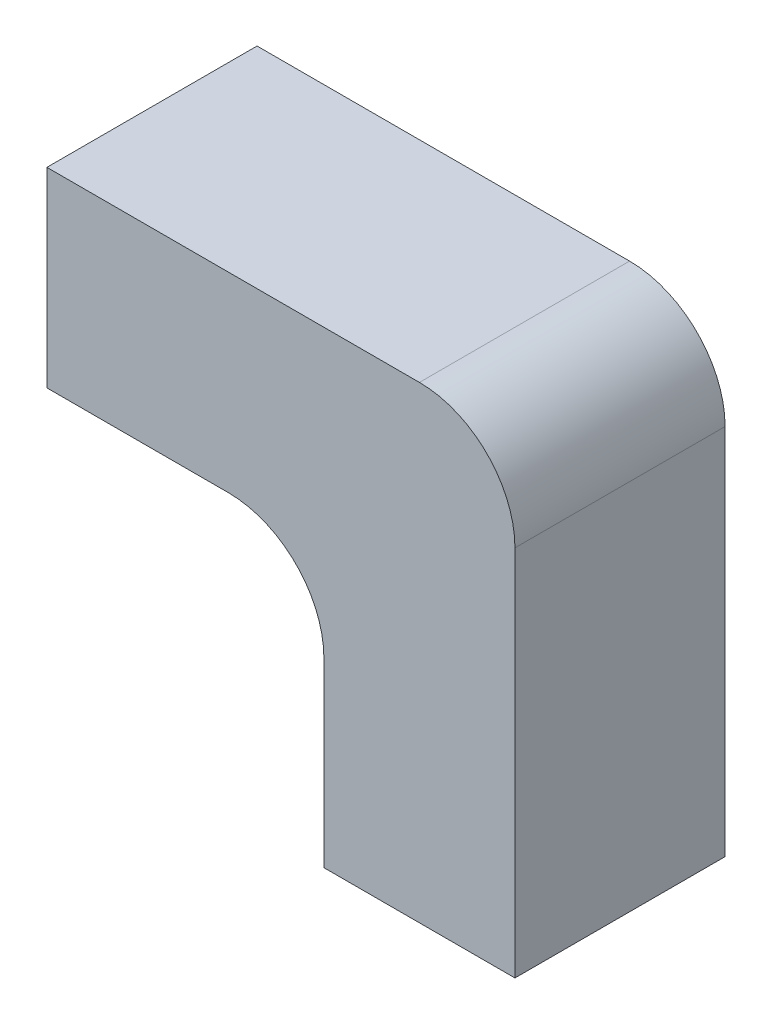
ISO-10303-21;
HEADER;
FILE_DESCRIPTION(('STEP AP214'),'2;1');
FILE_NAME('part.step','',(''),(''),'','','');
FILE_SCHEMA(('AUTOMOTIVE_DESIGN { 1 0 10303 214 1 1 1 1 }'));
ENDSEC;
DATA;
#1=APPLICATION_CONTEXT('core data for automotive mechanical design processes');
#2=APPLICATION_PROTOCOL_DEFINITION('international standard','automotive_design',2000,#1);
#3=PRODUCT_CONTEXT('',#1,'mechanical');
#4=PRODUCT('Part','Part','',(#3));
#5=PRODUCT_RELATED_PRODUCT_CATEGORY('part','',(#4));
#6=PRODUCT_DEFINITION_FORMATION('','',#4);
#7=PRODUCT_DEFINITION_CONTEXT('part definition',#1,'design');
#8=PRODUCT_DEFINITION('design','',#6,#7);
#9=PRODUCT_DEFINITION_SHAPE('','',#8);
#10=(LENGTH_UNIT() NAMED_UNIT(*) SI_UNIT(.MILLI.,.METRE.));
#11=(NAMED_UNIT(*) PLANE_ANGLE_UNIT() SI_UNIT($,.RADIAN.));
#12=(NAMED_UNIT(*) SI_UNIT($,.STERADIAN.) SOLID_ANGLE_UNIT());
#13=UNCERTAINTY_MEASURE_WITH_UNIT(LENGTH_MEASURE(1.E-05),#10,'distance_accuracy_value','');
#14=(GEOMETRIC_REPRESENTATION_CONTEXT(3) GLOBAL_UNCERTAINTY_ASSIGNED_CONTEXT((#13)) GLOBAL_UNIT_ASSIGNED_CONTEXT((#10,
#11,#12)) REPRESENTATION_CONTEXT('',''));
#15=CARTESIAN_POINT('',(0.,0.,0.));
#16=DIRECTION('',(0.,0.,1.));
#17=DIRECTION('',(1.,0.,0.));
#18=AXIS2_PLACEMENT_3D('',#15,#16,#17);
#19=CARTESIAN_POINT('',(-1.55137614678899,1.73165137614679,2.2));
#20=DIRECTION('',(1.,0.,0.));
#21=DIRECTION('',(0.,1.,0.));
#22=AXIS2_PLACEMENT_3D('',#19,#20,#21);
#23=PLANE('',#22);
#24=DIRECTION('',(0.,-1.,0.));
#25=VECTOR('',#24,1.);
#26=CARTESIAN_POINT('',(-1.55137614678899,1.73165137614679,0.));
#27=LINE('',#26,#25);
#28=CARTESIAN_POINT('',(-1.55137614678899,1.73165137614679,0.));
#29=VERTEX_POINT('',#28);
#30=CARTESIAN_POINT('',(-1.55137614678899,-0.26834862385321,0.));
#31=VERTEX_POINT('',#30);
#32=EDGE_CURVE('E123',#29,#31,#27,.T.);
#33=ORIENTED_EDGE('',*,*,#32,.T.);
#34=DIRECTION('',(0.,0.,-1.));
#35=VECTOR('',#34,1.);
#36=CARTESIAN_POINT('',(-1.55137614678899,-0.26834862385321,2.2));
#37=LINE('',#36,#35);
#38=CARTESIAN_POINT('',(-1.55137614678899,-0.26834862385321,2.2));
#39=VERTEX_POINT('',#38);
#40=EDGE_CURVE('E104',#39,#31,#37,.T.);
#41=ORIENTED_EDGE('',*,*,#40,.F.);
#42=DIRECTION('',(0.,-1.,0.));
#43=VECTOR('',#42,1.);
#44=CARTESIAN_POINT('',(-1.55137614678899,1.73165137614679,2.2));
#45=LINE('',#44,#43);
#46=CARTESIAN_POINT('',(-1.55137614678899,1.73165137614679,2.2));
#47=VERTEX_POINT('',#46);
#48=EDGE_CURVE('E111',#47,#39,#45,.T.);
#49=ORIENTED_EDGE('',*,*,#48,.F.);
#50=DIRECTION('',(0.,0.,-1.));
#51=VECTOR('',#50,1.);
#52=CARTESIAN_POINT('',(-1.55137614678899,1.73165137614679,2.2));
#53=LINE('',#52,#51);
#54=EDGE_CURVE('E162',#47,#29,#53,.T.);
#55=ORIENTED_EDGE('',*,*,#54,.T.);
#56=EDGE_LOOP('',(#33,#41,#49,#55));
#57=FACE_BOUND('',#56,.T.);
#58=ADVANCED_FACE('F33',(#57),#23,.F.);
#59=CARTESIAN_POINT('',(-1.55137614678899,-0.26834862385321,2.2));
#60=DIRECTION('',(0.,1.,0.));
#61=DIRECTION('',(0.,0.,1.));
#62=AXIS2_PLACEMENT_3D('',#59,#60,#61);
#63=PLANE('',#62);
#64=DIRECTION('',(1.,0.,0.));
#65=VECTOR('',#64,1.);
#66=CARTESIAN_POINT('',(-1.55137614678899,-0.26834862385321,0.));
#67=LINE('',#66,#65);
#68=CARTESIAN_POINT('',(0.348623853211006,-0.26834862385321,0.));
#69=VERTEX_POINT('',#68);
#70=EDGE_CURVE('E143',#31,#69,#67,.T.);
#71=ORIENTED_EDGE('',*,*,#70,.T.);
#72=DIRECTION('',(0.,0.,-1.));
#73=VECTOR('',#72,1.);
#74=CARTESIAN_POINT('',(0.348623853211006,-0.26834862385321,2.2));
#75=LINE('',#74,#73);
#76=CARTESIAN_POINT('',(0.348623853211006,-0.26834862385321,2.2));
#77=VERTEX_POINT('',#76);
#78=EDGE_CURVE('E107',#69,#77,#75,.F.);
#79=ORIENTED_EDGE('',*,*,#78,.T.);
#80=DIRECTION('',(1.,0.,0.));
#81=VECTOR('',#80,1.);
#82=CARTESIAN_POINT('',(-1.55137614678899,-0.26834862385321,2.2));
#83=LINE('',#82,#81);
#84=EDGE_CURVE('E99',#39,#77,#83,.T.);
#85=ORIENTED_EDGE('',*,*,#84,.F.);
#86=ORIENTED_EDGE('',*,*,#40,.T.);
#87=EDGE_LOOP('',(#71,#79,#85,#86));
#88=FACE_BOUND('',#87,.T.);
#89=ADVANCED_FACE('F102',(#88),#63,.F.);
#90=CARTESIAN_POINT('',(1.34862385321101,-0.26834862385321,2.2));
#91=DIRECTION('',(1.,0.,0.));
#92=DIRECTION('',(0.,1.,0.));
#93=AXIS2_PLACEMENT_3D('',#90,#91,#92);
#94=PLANE('',#93);
#95=DIRECTION('',(0.,-1.,0.));
#96=VECTOR('',#95,1.);
#97=CARTESIAN_POINT('',(1.34862385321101,-0.26834862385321,2.2));
#98=LINE('',#97,#96);
#99=CARTESIAN_POINT('',(1.34862385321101,-1.26834862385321,2.2));
#100=VERTEX_POINT('',#99);
#101=CARTESIAN_POINT('',(1.34862385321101,-3.16834862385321,2.2));
#102=VERTEX_POINT('',#101);
#103=EDGE_CURVE('E110',#100,#102,#98,.T.);
#104=ORIENTED_EDGE('',*,*,#103,.F.);
#105=DIRECTION('',(0.,0.,-1.));
#106=VECTOR('',#105,1.);
#107=CARTESIAN_POINT('',(1.34862385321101,-1.26834862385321,0.));
#108=LINE('',#107,#106);
#109=CARTESIAN_POINT('',(1.34862385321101,-1.26834862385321,0.));
#110=VERTEX_POINT('',#109);
#111=EDGE_CURVE('E124',#100,#110,#108,.T.);
#112=ORIENTED_EDGE('',*,*,#111,.T.);
#113=DIRECTION('',(0.,-1.,0.));
#114=VECTOR('',#113,1.);
#115=CARTESIAN_POINT('',(1.34862385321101,-0.26834862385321,0.));
#116=LINE('',#115,#114);
#117=CARTESIAN_POINT('',(1.34862385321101,-3.16834862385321,0.));
#118=VERTEX_POINT('',#117);
#119=EDGE_CURVE('E145',#110,#118,#116,.T.);
#120=ORIENTED_EDGE('',*,*,#119,.T.);
#121=DIRECTION('',(0.,0.,-1.));
#122=VECTOR('',#121,1.);
#123=CARTESIAN_POINT('',(1.34862385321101,-3.16834862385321,2.2));
#124=LINE('',#123,#122);
#125=EDGE_CURVE('E125',#102,#118,#124,.T.);
#126=ORIENTED_EDGE('',*,*,#125,.F.);
#127=EDGE_LOOP('',(#104,#112,#120,#126));
#128=FACE_BOUND('',#127,.T.);
#129=ADVANCED_FACE('F153',(#128),#94,.F.);
#130=CARTESIAN_POINT('',(1.34862385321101,-3.16834862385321,2.2));
#131=DIRECTION('',(0.,1.,0.));
#132=DIRECTION('',(0.,0.,1.));
#133=AXIS2_PLACEMENT_3D('',#130,#131,#132);
#134=PLANE('',#133);
#135=DIRECTION('',(1.,0.,0.));
#136=VECTOR('',#135,1.);
#137=CARTESIAN_POINT('',(1.34862385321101,-3.16834862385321,0.));
#138=LINE('',#137,#136);
#139=CARTESIAN_POINT('',(3.34862385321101,-3.16834862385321,0.));
#140=VERTEX_POINT('',#139);
#141=EDGE_CURVE('E165',#118,#140,#138,.T.);
#142=ORIENTED_EDGE('',*,*,#141,.T.);
#143=DIRECTION('',(0.,0.,-1.));
#144=VECTOR('',#143,1.);
#145=CARTESIAN_POINT('',(3.34862385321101,-3.16834862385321,2.2));
#146=LINE('',#145,#144);
#147=CARTESIAN_POINT('',(3.34862385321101,-3.16834862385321,2.2));
#148=VERTEX_POINT('',#147);
#149=EDGE_CURVE('E130',#148,#140,#146,.T.);
#150=ORIENTED_EDGE('',*,*,#149,.F.);
#151=DIRECTION('',(1.,0.,0.));
#152=VECTOR('',#151,1.);
#153=CARTESIAN_POINT('',(1.34862385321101,-3.16834862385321,2.2));
#154=LINE('',#153,#152);
#155=EDGE_CURVE('E155',#102,#148,#154,.T.);
#156=ORIENTED_EDGE('',*,*,#155,.F.);
#157=ORIENTED_EDGE('',*,*,#125,.T.);
#158=EDGE_LOOP('',(#142,#150,#156,#157));
#159=FACE_BOUND('',#158,.T.);
#160=ADVANCED_FACE('F174',(#159),#134,.F.);
#161=CARTESIAN_POINT('',(3.34862385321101,1.73165137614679,2.2));
#162=DIRECTION('',(-1.,0.,0.));
#163=DIRECTION('',(0.,0.,1.));
#164=AXIS2_PLACEMENT_3D('',#161,#162,#163);
#165=PLANE('',#164);
#166=DIRECTION('',(0.,1.,0.));
#167=VECTOR('',#166,1.);
#168=CARTESIAN_POINT('',(3.34862385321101,1.73165137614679,0.));
#169=LINE('',#168,#167);
#170=CARTESIAN_POINT('',(3.34862385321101,0.73165137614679,0.));
#171=VERTEX_POINT('',#170);
#172=EDGE_CURVE('E167',#140,#171,#169,.T.);
#173=ORIENTED_EDGE('',*,*,#172,.T.);
#174=DIRECTION('',(0.,0.,-1.));
#175=VECTOR('',#174,1.);
#176=CARTESIAN_POINT('',(3.34862385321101,0.73165137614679,2.2));
#177=LINE('',#176,#175);
#178=CARTESIAN_POINT('',(3.34862385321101,0.73165137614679,2.2));
#179=VERTEX_POINT('',#178);
#180=EDGE_CURVE('E48',#171,#179,#177,.F.);
#181=ORIENTED_EDGE('',*,*,#180,.T.);
#182=DIRECTION('',(0.,1.,0.));
#183=VECTOR('',#182,1.);
#184=CARTESIAN_POINT('',(3.34862385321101,1.73165137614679,2.2));
#185=LINE('',#184,#183);
#186=EDGE_CURVE('E157',#148,#179,#185,.T.);
#187=ORIENTED_EDGE('',*,*,#186,.F.);
#188=ORIENTED_EDGE('',*,*,#149,.T.);
#189=EDGE_LOOP('',(#173,#181,#187,#188));
#190=FACE_BOUND('',#189,.T.);
#191=ADVANCED_FACE('F172',(#190),#165,.F.);
#192=CARTESIAN_POINT('',(-1.55137614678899,1.73165137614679,2.2));
#193=DIRECTION('',(0.,-1.,0.));
#194=DIRECTION('',(0.,0.,-1.));
#195=AXIS2_PLACEMENT_3D('',#192,#193,#194);
#196=PLANE('',#195);
#197=DIRECTION('',(-1.,0.,0.));
#198=VECTOR('',#197,1.);
#199=CARTESIAN_POINT('',(-1.55137614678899,1.73165137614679,2.2));
#200=LINE('',#199,#198);
#201=CARTESIAN_POINT('',(2.34862385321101,1.73165137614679,2.2));
#202=VERTEX_POINT('',#201);
#203=EDGE_CURVE('E116',#202,#47,#200,.T.);
#204=ORIENTED_EDGE('',*,*,#203,.F.);
#205=DIRECTION('',(0.,0.,-1.));
#206=VECTOR('',#205,1.);
#207=CARTESIAN_POINT('',(2.34862385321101,1.73165137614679,2.2));
#208=LINE('',#207,#206);
#209=CARTESIAN_POINT('',(2.34862385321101,1.73165137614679,0.));
#210=VERTEX_POINT('',#209);
#211=EDGE_CURVE('E135',#202,#210,#208,.T.);
#212=ORIENTED_EDGE('',*,*,#211,.T.);
#213=DIRECTION('',(-1.,0.,0.));
#214=VECTOR('',#213,1.);
#215=CARTESIAN_POINT('',(-1.55137614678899,1.73165137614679,0.));
#216=LINE('',#215,#214);
#217=EDGE_CURVE('E120',#210,#29,#216,.T.);
#218=ORIENTED_EDGE('',*,*,#217,.T.);
#219=ORIENTED_EDGE('',*,*,#54,.F.);
#220=EDGE_LOOP('',(#204,#212,#218,#219));
#221=FACE_BOUND('',#220,.T.);
#222=ADVANCED_FACE('F179',(#221),#196,.F.);
#223=CARTESIAN_POINT('',(0.,0.,2.2));
#224=DIRECTION('',(0.,0.,1.));
#225=DIRECTION('',(1.,0.,0.));
#226=AXIS2_PLACEMENT_3D('',#223,#224,#225);
#227=PLANE('',#226);
#228=ORIENTED_EDGE('',*,*,#186,.T.);
#229=CARTESIAN_POINT('',(2.34862385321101,0.73165137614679,2.2));
#230=DIRECTION('',(0.,0.,1.));
#231=DIRECTION('',(1.,0.,0.));
#232=AXIS2_PLACEMENT_3D('',#229,#230,#231);
#233=CIRCLE('',#232,1.);
#234=EDGE_CURVE('E140',#179,#202,#233,.T.);
#235=ORIENTED_EDGE('',*,*,#234,.T.);
#236=ORIENTED_EDGE('',*,*,#203,.T.);
#237=ORIENTED_EDGE('',*,*,#48,.T.);
#238=ORIENTED_EDGE('',*,*,#84,.T.);
#239=CARTESIAN_POINT('',(0.348623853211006,-1.26834862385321,2.2));
#240=DIRECTION('',(0.,0.,1.));
#241=DIRECTION('',(1.,0.,0.));
#242=AXIS2_PLACEMENT_3D('',#239,#240,#241);
#243=CIRCLE('',#242,1.);
#244=EDGE_CURVE('E11',#77,#100,#243,.F.);
#245=ORIENTED_EDGE('',*,*,#244,.T.);
#246=ORIENTED_EDGE('',*,*,#103,.T.);
#247=ORIENTED_EDGE('',*,*,#155,.T.);
#248=EDGE_LOOP('',(#228,#235,#236,#237,#238,#245,#246,#247));
#249=FACE_BOUND('',#248,.T.);
#250=ADVANCED_FACE('F114',(#249),#227,.T.);
#251=CARTESIAN_POINT('',(0.,0.,0.));
#252=DIRECTION('',(0.,0.,1.));
#253=DIRECTION('',(1.,0.,0.));
#254=AXIS2_PLACEMENT_3D('',#251,#252,#253);
#255=PLANE('',#254);
#256=ORIENTED_EDGE('',*,*,#217,.F.);
#257=CARTESIAN_POINT('',(2.34862385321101,0.73165137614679,0.));
#258=DIRECTION('',(0.,0.,1.));
#259=DIRECTION('',(1.,0.,0.));
#260=AXIS2_PLACEMENT_3D('',#257,#258,#259);
#261=CIRCLE('',#260,1.);
#262=EDGE_CURVE('E56',#210,#171,#261,.F.);
#263=ORIENTED_EDGE('',*,*,#262,.T.);
#264=ORIENTED_EDGE('',*,*,#172,.F.);
#265=ORIENTED_EDGE('',*,*,#141,.F.);
#266=ORIENTED_EDGE('',*,*,#119,.F.);
#267=CARTESIAN_POINT('',(0.348623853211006,-1.26834862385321,0.));
#268=DIRECTION('',(0.,0.,1.));
#269=DIRECTION('',(1.,0.,0.));
#270=AXIS2_PLACEMENT_3D('',#267,#268,#269);
#271=CIRCLE('',#270,1.);
#272=EDGE_CURVE('E41',#110,#69,#271,.T.);
#273=ORIENTED_EDGE('',*,*,#272,.T.);
#274=ORIENTED_EDGE('',*,*,#70,.F.);
#275=ORIENTED_EDGE('',*,*,#32,.F.);
#276=EDGE_LOOP('',(#256,#263,#264,#265,#266,#273,#274,#275));
#277=FACE_BOUND('',#276,.T.);
#278=ADVANCED_FACE('F142',(#277),#255,.F.);
#279=CARTESIAN_POINT('',(0.348623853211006,-1.26834862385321,2.2));
#280=DIRECTION('',(0.,0.,1.));
#281=DIRECTION('',(1.,0.,0.));
#282=AXIS2_PLACEMENT_3D('',#279,#280,#281);
#283=CYLINDRICAL_SURFACE('',#282,1.);
#284=ORIENTED_EDGE('',*,*,#244,.F.);
#285=ORIENTED_EDGE('',*,*,#78,.F.);
#286=ORIENTED_EDGE('',*,*,#272,.F.);
#287=ORIENTED_EDGE('',*,*,#111,.F.);
#288=EDGE_LOOP('',(#284,#285,#286,#287));
#289=FACE_BOUND('',#288,.T.);
#290=ADVANCED_FACE('F149',(#289),#283,.F.);
#291=CARTESIAN_POINT('',(2.34862385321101,0.73165137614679,2.2));
#292=DIRECTION('',(0.,0.,-1.));
#293=DIRECTION('',(-1.,0.,0.));
#294=AXIS2_PLACEMENT_3D('',#291,#292,#293);
#295=CYLINDRICAL_SURFACE('',#294,1.);
#296=ORIENTED_EDGE('',*,*,#234,.F.);
#297=ORIENTED_EDGE('',*,*,#180,.F.);
#298=ORIENTED_EDGE('',*,*,#262,.F.);
#299=ORIENTED_EDGE('',*,*,#211,.F.);
#300=EDGE_LOOP('',(#296,#297,#298,#299));
#301=FACE_BOUND('',#300,.T.);
#302=ADVANCED_FACE('F35',(#301),#295,.T.);
#303=CLOSED_SHELL('',(#58,#89,#129,#160,#191,#222,#250,#278,#290,#302));
#304=MANIFOLD_SOLID_BREP('B2',#303);
#305=ADVANCED_BREP_SHAPE_REPRESENTATION('',(#18,#304),#14);
#306=SHAPE_DEFINITION_REPRESENTATION(#9,#305);
ENDSEC;
END-ISO-10303-21;
